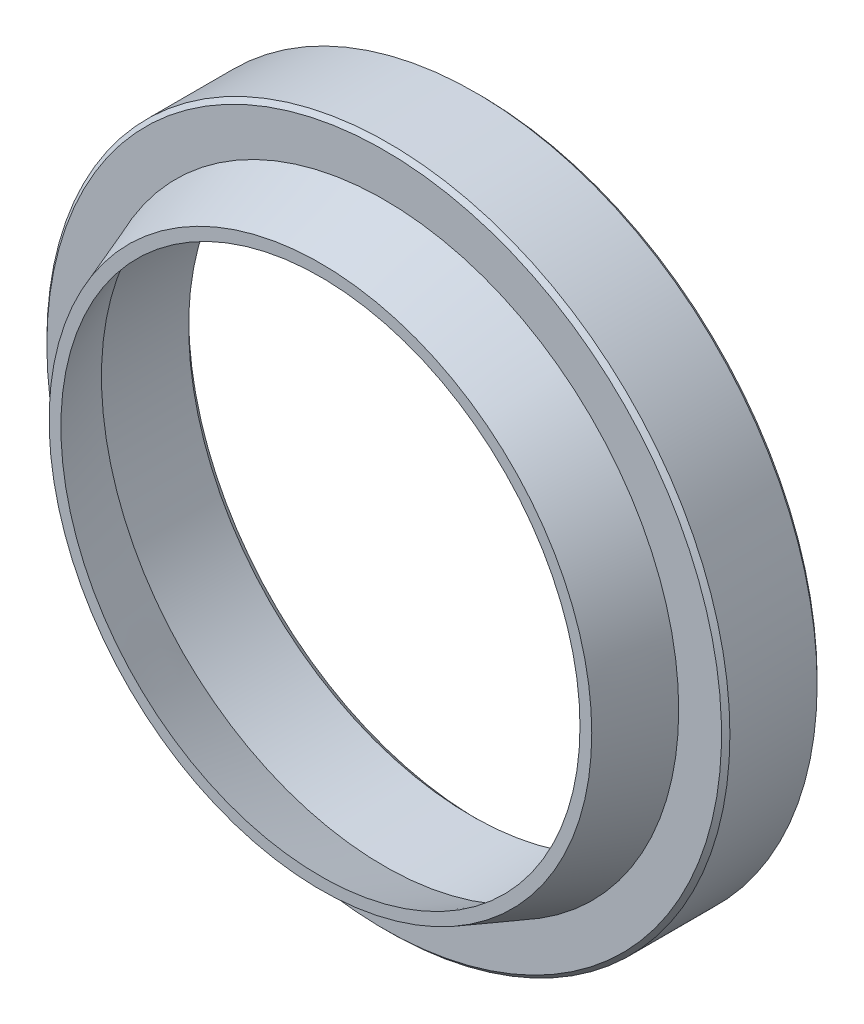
from build123d import *

# Parameters (mm, degrees)
ENDCHAMFER_SIZE  = 0.614285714
BODYCHAMFER_SIZE = 0.307142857


with BuildPart() as part:
    # Sketch1 → Body (revolve)
    with BuildSketch(Plane(origin=(25, 0, -4.51618793), x_dir=(-1, 0, 0), z_dir=(0, 1, 0)), mode=Mode.PRIVATE) as body_sk:
        Polygon((45.7, -7.150478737), (45.7, -0.154523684), (44, 4.51618793), (44.86147224, 4.51618793), (46.56, -0.150478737), (50, -0.150478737), (50, -7.150478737), align=None)
    revolve(body_sk.sketch.rotate(Axis((0, 0, 4.679710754), (0, 0, -1)), 180), axis=Axis((0, 0, 4.679710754), (0, 0, -1)))

    # EndChamfer
    endchamfer_edges = [part.edges().sort_by_distance(p)[0] for p in [
        (-20.7, 0, -11.666666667),
    ]]
    chamfer(endchamfer_edges, length=ENDCHAMFER_SIZE)

    # BodyChamfer
    bodychamfer_edges = [part.edges().sort_by_distance(p)[0] for p in [
        (-25, 0, -4.666666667),
        (-25, 0, -11.666666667),
    ]]
    chamfer(bodychamfer_edges, length=BODYCHAMFER_SIZE)


solid = part.part
